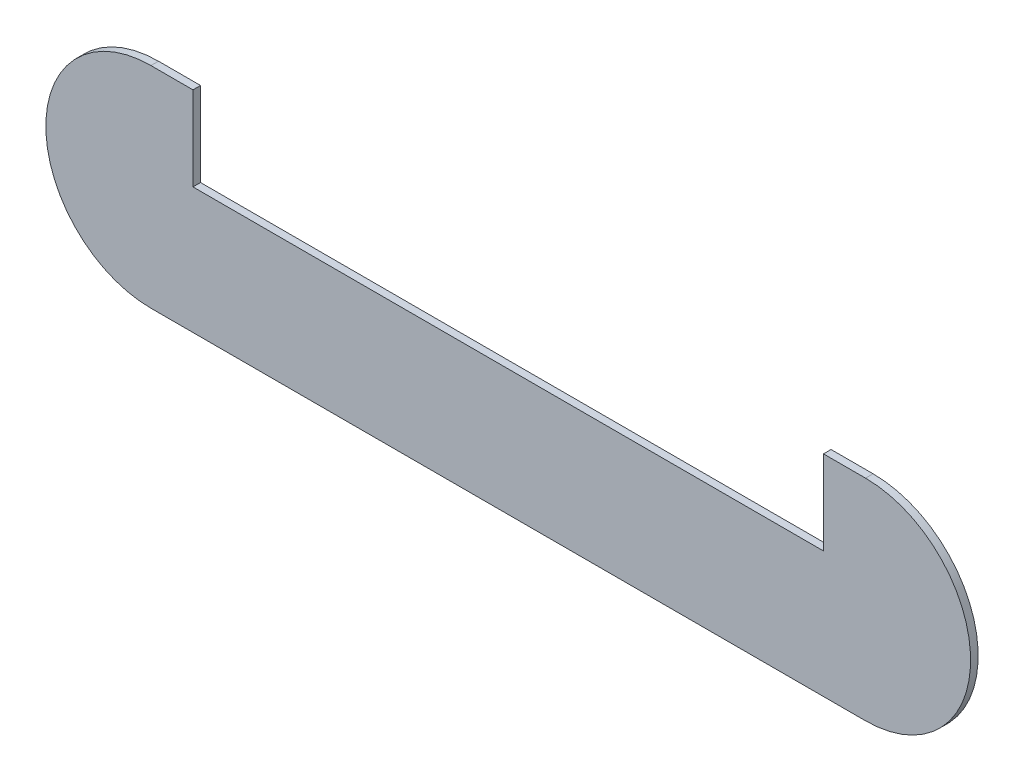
ISO-10303-21;
HEADER;
FILE_DESCRIPTION(('STEP AP214'),'2;1');
FILE_NAME('part.step','',(''),(''),'','','');
FILE_SCHEMA(('AUTOMOTIVE_DESIGN { 1 0 10303 214 1 1 1 1 }'));
ENDSEC;
DATA;
#1=APPLICATION_CONTEXT('core data for automotive mechanical design processes');
#2=APPLICATION_PROTOCOL_DEFINITION('international standard','automotive_design',2000,#1);
#3=PRODUCT_CONTEXT('',#1,'mechanical');
#4=PRODUCT('Part','Part','',(#3));
#5=PRODUCT_RELATED_PRODUCT_CATEGORY('part','',(#4));
#6=PRODUCT_DEFINITION_FORMATION('','',#4);
#7=PRODUCT_DEFINITION_CONTEXT('part definition',#1,'design');
#8=PRODUCT_DEFINITION('design','',#6,#7);
#9=PRODUCT_DEFINITION_SHAPE('','',#8);
#10=(LENGTH_UNIT() NAMED_UNIT(*) SI_UNIT(.MILLI.,.METRE.));
#11=(NAMED_UNIT(*) PLANE_ANGLE_UNIT() SI_UNIT($,.RADIAN.));
#12=(NAMED_UNIT(*) SI_UNIT($,.STERADIAN.) SOLID_ANGLE_UNIT());
#13=UNCERTAINTY_MEASURE_WITH_UNIT(LENGTH_MEASURE(1.E-05),#10,'distance_accuracy_value','');
#14=(GEOMETRIC_REPRESENTATION_CONTEXT(3) GLOBAL_UNCERTAINTY_ASSIGNED_CONTEXT((#13)) GLOBAL_UNIT_ASSIGNED_CONTEXT((#10,
#11,#12)) REPRESENTATION_CONTEXT('',''));
#15=CARTESIAN_POINT('',(0.,0.,0.));
#16=DIRECTION('',(0.,0.,1.));
#17=DIRECTION('',(1.,0.,0.));
#18=AXIS2_PLACEMENT_3D('',#15,#16,#17);
#19=CARTESIAN_POINT('',(-850.000000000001,250.,18.));
#20=DIRECTION('',(0.,-1.,0.));
#21=DIRECTION('',(0.,0.,-1.));
#22=AXIS2_PLACEMENT_3D('',#19,#20,#21);
#23=PLANE('',#22);
#24=DIRECTION('',(0.,0.,-1.));
#25=VECTOR('',#24,1.);
#26=CARTESIAN_POINT('',(-750.000000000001,250.,2860.71829828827));
#27=LINE('',#26,#25);
#28=CARTESIAN_POINT('',(-750.000000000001,250.,17.9999999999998));
#29=VERTEX_POINT('',#28);
#30=CARTESIAN_POINT('',(-750.,250.,0.));
#31=VERTEX_POINT('',#30);
#32=EDGE_CURVE('E162',#29,#31,#27,.T.);
#33=ORIENTED_EDGE('',*,*,#32,.T.);
#34=DIRECTION('',(-1.,0.,0.));
#35=VECTOR('',#34,1.);
#36=CARTESIAN_POINT('',(-850.000000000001,250.,0.));
#37=LINE('',#36,#35);
#38=CARTESIAN_POINT('',(-850.000000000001,250.,0.));
#39=VERTEX_POINT('',#38);
#40=EDGE_CURVE('E127',#31,#39,#37,.T.);
#41=ORIENTED_EDGE('',*,*,#40,.T.);
#42=DIRECTION('',(0.,0.,-1.));
#43=VECTOR('',#42,1.);
#44=CARTESIAN_POINT('',(-850.000000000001,250.,18.));
#45=LINE('',#44,#43);
#46=CARTESIAN_POINT('',(-850.000000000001,250.,18.));
#47=VERTEX_POINT('',#46);
#48=EDGE_CURVE('E41',#47,#39,#45,.T.);
#49=ORIENTED_EDGE('',*,*,#48,.F.);
#50=DIRECTION('',(-1.,0.,0.));
#51=VECTOR('',#50,1.);
#52=CARTESIAN_POINT('',(-850.000000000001,250.,18.));
#53=LINE('',#52,#51);
#54=EDGE_CURVE('E167',#29,#47,#53,.T.);
#55=ORIENTED_EDGE('',*,*,#54,.F.);
#56=EDGE_LOOP('',(#33,#41,#49,#55));
#57=FACE_BOUND('',#56,.T.);
#58=ADVANCED_FACE('F33',(#57),#23,.F.);
#59=DIRECTION('',(0.,0.,-1.));
#60=VECTOR('',#59,1.);
#61=CARTESIAN_POINT('',(750.,250.,2860.71829828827));
#62=LINE('',#61,#60);
#63=CARTESIAN_POINT('',(750.,250.,17.9999999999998));
#64=VERTEX_POINT('',#63);
#65=CARTESIAN_POINT('',(750.,250.,0.));
#66=VERTEX_POINT('',#65);
#67=EDGE_CURVE('E106',#64,#66,#62,.T.);
#68=ORIENTED_EDGE('',*,*,#67,.F.);
#69=CARTESIAN_POINT('',(850.,250.,18.));
#70=VERTEX_POINT('',#69);
#71=EDGE_CURVE('E85',#70,#64,#53,.T.);
#72=ORIENTED_EDGE('',*,*,#71,.F.);
#73=DIRECTION('',(0.,0.,-1.));
#74=VECTOR('',#73,1.);
#75=CARTESIAN_POINT('',(850.,250.,18.));
#76=LINE('',#75,#74);
#77=CARTESIAN_POINT('',(850.,250.,0.));
#78=VERTEX_POINT('',#77);
#79=EDGE_CURVE('E11',#70,#78,#76,.T.);
#80=ORIENTED_EDGE('',*,*,#79,.T.);
#81=EDGE_CURVE('E119',#78,#66,#37,.T.);
#82=ORIENTED_EDGE('',*,*,#81,.T.);
#83=EDGE_LOOP('',(#68,#72,#80,#82));
#84=FACE_BOUND('',#83,.T.);
#85=ADVANCED_FACE('F123',(#84),#23,.F.);
#86=CARTESIAN_POINT('',(850.,-1.11022302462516E-13,18.));
#87=DIRECTION('',(0.,0.,1.));
#88=DIRECTION('',(1.,0.,0.));
#89=AXIS2_PLACEMENT_3D('',#86,#87,#88);
#90=PLANE('',#89);
#91=DIRECTION('',(1.,0.,0.));
#92=VECTOR('',#91,1.);
#93=CARTESIAN_POINT('',(-750.000000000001,49.9999999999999,17.9999999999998));
#94=LINE('',#93,#92);
#95=CARTESIAN_POINT('',(-750.000000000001,49.9999999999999,17.9999999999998));
#96=VERTEX_POINT('',#95);
#97=CARTESIAN_POINT('',(750.,49.9999999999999,17.9999999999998));
#98=VERTEX_POINT('',#97);
#99=EDGE_CURVE('E151',#96,#98,#94,.T.);
#100=ORIENTED_EDGE('',*,*,#99,.F.);
#101=DIRECTION('',(0.,-1.,0.));
#102=VECTOR('',#101,1.);
#103=CARTESIAN_POINT('',(-750.000000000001,250.,17.9999999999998));
#104=LINE('',#103,#102);
#105=EDGE_CURVE('E153',#29,#96,#104,.T.);
#106=ORIENTED_EDGE('',*,*,#105,.F.);
#107=ORIENTED_EDGE('',*,*,#54,.T.);
#108=CARTESIAN_POINT('',(-850.000000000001,-1.11022302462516E-13,18.));
#109=DIRECTION('',(0.,0.,1.));
#110=DIRECTION('',(1.,0.,0.));
#111=AXIS2_PLACEMENT_3D('',#108,#109,#110);
#112=CIRCLE('',#111,250.);
#113=CARTESIAN_POINT('',(-850.000000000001,-250.,18.));
#114=VERTEX_POINT('',#113);
#115=EDGE_CURVE('E146',#47,#114,#112,.T.);
#116=ORIENTED_EDGE('',*,*,#115,.T.);
#117=DIRECTION('',(1.,0.,0.));
#118=VECTOR('',#117,1.);
#119=CARTESIAN_POINT('',(-850.000000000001,-250.,18.));
#120=LINE('',#119,#118);
#121=CARTESIAN_POINT('',(850.,-250.,18.));
#122=VERTEX_POINT('',#121);
#123=EDGE_CURVE('E57',#114,#122,#120,.T.);
#124=ORIENTED_EDGE('',*,*,#123,.T.);
#125=CARTESIAN_POINT('',(850.,-1.11022302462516E-13,18.));
#126=DIRECTION('',(0.,0.,1.));
#127=DIRECTION('',(1.,0.,0.));
#128=AXIS2_PLACEMENT_3D('',#125,#126,#127);
#129=CIRCLE('',#128,250.);
#130=EDGE_CURVE('E135',#122,#70,#129,.T.);
#131=ORIENTED_EDGE('',*,*,#130,.T.);
#132=ORIENTED_EDGE('',*,*,#71,.T.);
#133=DIRECTION('',(0.,1.,0.));
#134=VECTOR('',#133,1.);
#135=CARTESIAN_POINT('',(750.,49.9999999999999,17.9999999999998));
#136=LINE('',#135,#134);
#137=EDGE_CURVE('E112',#98,#64,#136,.T.);
#138=ORIENTED_EDGE('',*,*,#137,.F.);
#139=EDGE_LOOP('',(#100,#106,#107,#116,#124,#131,#132,#138));
#140=FACE_BOUND('',#139,.T.);
#141=ADVANCED_FACE('F170',(#140),#90,.T.);
#142=CARTESIAN_POINT('',(850.,-1.11022302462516E-13,18.));
#143=DIRECTION('',(0.,0.,-1.));
#144=DIRECTION('',(-1.,0.,0.));
#145=AXIS2_PLACEMENT_3D('',#142,#143,#144);
#146=CYLINDRICAL_SURFACE('',#145,250.);
#147=CARTESIAN_POINT('',(850.,-1.11022302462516E-13,0.));
#148=DIRECTION('',(0.,0.,1.));
#149=DIRECTION('',(1.,0.,0.));
#150=AXIS2_PLACEMENT_3D('',#147,#148,#149);
#151=CIRCLE('',#150,250.);
#152=CARTESIAN_POINT('',(850.,-250.,0.));
#153=VERTEX_POINT('',#152);
#154=EDGE_CURVE('E130',#153,#78,#151,.T.);
#155=ORIENTED_EDGE('',*,*,#154,.T.);
#156=ORIENTED_EDGE('',*,*,#79,.F.);
#157=ORIENTED_EDGE('',*,*,#130,.F.);
#158=DIRECTION('',(0.,0.,-1.));
#159=VECTOR('',#158,1.);
#160=CARTESIAN_POINT('',(850.,-250.,18.));
#161=LINE('',#160,#159);
#162=EDGE_CURVE('E136',#122,#153,#161,.T.);
#163=ORIENTED_EDGE('',*,*,#162,.T.);
#164=EDGE_LOOP('',(#155,#156,#157,#163));
#165=FACE_BOUND('',#164,.T.);
#166=ADVANCED_FACE('F35',(#165),#146,.T.);
#167=CARTESIAN_POINT('',(-850.000000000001,-1.11022302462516E-13,18.));
#168=DIRECTION('',(0.,0.,-1.));
#169=DIRECTION('',(-1.,0.,0.));
#170=AXIS2_PLACEMENT_3D('',#167,#168,#169);
#171=CYLINDRICAL_SURFACE('',#170,250.);
#172=CARTESIAN_POINT('',(-850.000000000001,-1.11022302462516E-13,0.));
#173=DIRECTION('',(0.,0.,1.));
#174=DIRECTION('',(1.,0.,0.));
#175=AXIS2_PLACEMENT_3D('',#172,#173,#174);
#176=CIRCLE('',#175,250.);
#177=CARTESIAN_POINT('',(-850.000000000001,-250.,0.));
#178=VERTEX_POINT('',#177);
#179=EDGE_CURVE('E126',#39,#178,#176,.T.);
#180=ORIENTED_EDGE('',*,*,#179,.T.);
#181=DIRECTION('',(0.,0.,-1.));
#182=VECTOR('',#181,1.);
#183=CARTESIAN_POINT('',(-850.000000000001,-250.,18.));
#184=LINE('',#183,#182);
#185=EDGE_CURVE('E138',#114,#178,#184,.T.);
#186=ORIENTED_EDGE('',*,*,#185,.F.);
#187=ORIENTED_EDGE('',*,*,#115,.F.);
#188=ORIENTED_EDGE('',*,*,#48,.T.);
#189=EDGE_LOOP('',(#180,#186,#187,#188));
#190=FACE_BOUND('',#189,.T.);
#191=ADVANCED_FACE('F144',(#190),#171,.T.);
#192=CARTESIAN_POINT('',(-850.000000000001,-250.,18.));
#193=DIRECTION('',(0.,1.,0.));
#194=DIRECTION('',(0.,0.,1.));
#195=AXIS2_PLACEMENT_3D('',#192,#193,#194);
#196=PLANE('',#195);
#197=DIRECTION('',(1.,0.,0.));
#198=VECTOR('',#197,1.);
#199=CARTESIAN_POINT('',(-850.000000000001,-250.,0.));
#200=LINE('',#199,#198);
#201=EDGE_CURVE('E78',#178,#153,#200,.T.);
#202=ORIENTED_EDGE('',*,*,#201,.T.);
#203=ORIENTED_EDGE('',*,*,#162,.F.);
#204=ORIENTED_EDGE('',*,*,#123,.F.);
#205=ORIENTED_EDGE('',*,*,#185,.T.);
#206=EDGE_LOOP('',(#202,#203,#204,#205));
#207=FACE_BOUND('',#206,.T.);
#208=ADVANCED_FACE('F172',(#207),#196,.F.);
#209=CARTESIAN_POINT('',(850.,-1.11022302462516E-13,0.));
#210=DIRECTION('',(0.,0.,1.));
#211=DIRECTION('',(1.,0.,0.));
#212=AXIS2_PLACEMENT_3D('',#209,#210,#211);
#213=PLANE('',#212);
#214=DIRECTION('',(1.,0.,0.));
#215=VECTOR('',#214,1.);
#216=CARTESIAN_POINT('',(-750.000000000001,49.9999999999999,0.));
#217=LINE('',#216,#215);
#218=CARTESIAN_POINT('',(-750.,49.9999999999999,0.));
#219=VERTEX_POINT('',#218);
#220=CARTESIAN_POINT('',(750.,49.9999999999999,0.));
#221=VERTEX_POINT('',#220);
#222=EDGE_CURVE('E121',#219,#221,#217,.T.);
#223=ORIENTED_EDGE('',*,*,#222,.T.);
#224=DIRECTION('',(0.,1.,0.));
#225=VECTOR('',#224,1.);
#226=CARTESIAN_POINT('',(750.,49.9999999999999,0.));
#227=LINE('',#226,#225);
#228=EDGE_CURVE('E109',#221,#66,#227,.T.);
#229=ORIENTED_EDGE('',*,*,#228,.T.);
#230=ORIENTED_EDGE('',*,*,#81,.F.);
#231=ORIENTED_EDGE('',*,*,#154,.F.);
#232=ORIENTED_EDGE('',*,*,#201,.F.);
#233=ORIENTED_EDGE('',*,*,#179,.F.);
#234=ORIENTED_EDGE('',*,*,#40,.F.);
#235=DIRECTION('',(0.,-1.,0.));
#236=VECTOR('',#235,1.);
#237=CARTESIAN_POINT('',(-750.000000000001,250.,0.));
#238=LINE('',#237,#236);
#239=EDGE_CURVE('E114',#31,#219,#238,.T.);
#240=ORIENTED_EDGE('',*,*,#239,.T.);
#241=EDGE_LOOP('',(#223,#229,#230,#231,#232,#233,#234,#240));
#242=FACE_BOUND('',#241,.T.);
#243=ADVANCED_FACE('F117',(#242),#213,.F.);
#244=CARTESIAN_POINT('',(-750.000000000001,250.,2860.71829828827));
#245=DIRECTION('',(1.,0.,0.));
#246=DIRECTION('',(0.,0.,-1.));
#247=AXIS2_PLACEMENT_3D('',#244,#245,#246);
#248=PLANE('',#247);
#249=ORIENTED_EDGE('',*,*,#32,.F.);
#250=ORIENTED_EDGE('',*,*,#105,.T.);
#251=DIRECTION('',(0.,0.,-1.));
#252=VECTOR('',#251,1.);
#253=CARTESIAN_POINT('',(-750.000000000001,49.9999999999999,2860.71829828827));
#254=LINE('',#253,#252);
#255=EDGE_CURVE('E159',#96,#219,#254,.T.);
#256=ORIENTED_EDGE('',*,*,#255,.T.);
#257=ORIENTED_EDGE('',*,*,#239,.F.);
#258=EDGE_LOOP('',(#249,#250,#256,#257));
#259=FACE_BOUND('',#258,.T.);
#260=ADVANCED_FACE('F177',(#259),#248,.T.);
#261=CARTESIAN_POINT('',(-750.000000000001,49.9999999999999,2860.71829828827));
#262=DIRECTION('',(0.,1.,0.));
#263=DIRECTION('',(0.,0.,1.));
#264=AXIS2_PLACEMENT_3D('',#261,#262,#263);
#265=PLANE('',#264);
#266=ORIENTED_EDGE('',*,*,#255,.F.);
#267=ORIENTED_EDGE('',*,*,#99,.T.);
#268=DIRECTION('',(0.,0.,-1.));
#269=VECTOR('',#268,1.);
#270=CARTESIAN_POINT('',(750.,49.9999999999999,2860.71829828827));
#271=LINE('',#270,#269);
#272=EDGE_CURVE('E48',#98,#221,#271,.T.);
#273=ORIENTED_EDGE('',*,*,#272,.T.);
#274=ORIENTED_EDGE('',*,*,#222,.F.);
#275=EDGE_LOOP('',(#266,#267,#273,#274));
#276=FACE_BOUND('',#275,.T.);
#277=ADVANCED_FACE('F175',(#276),#265,.T.);
#278=CARTESIAN_POINT('',(750.,49.9999999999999,2860.71829828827));
#279=DIRECTION('',(-1.,0.,0.));
#280=DIRECTION('',(0.,0.,1.));
#281=AXIS2_PLACEMENT_3D('',#278,#279,#280);
#282=PLANE('',#281);
#283=ORIENTED_EDGE('',*,*,#272,.F.);
#284=ORIENTED_EDGE('',*,*,#137,.T.);
#285=ORIENTED_EDGE('',*,*,#67,.T.);
#286=ORIENTED_EDGE('',*,*,#228,.F.);
#287=EDGE_LOOP('',(#283,#284,#285,#286));
#288=FACE_BOUND('',#287,.T.);
#289=ADVANCED_FACE('F108',(#288),#282,.T.);
#290=CLOSED_SHELL('',(#58,#85,#141,#166,#191,#208,#243,#260,#277,#289));
#291=MANIFOLD_SOLID_BREP('B2',#290);
#292=ADVANCED_BREP_SHAPE_REPRESENTATION('',(#18,#291),#14);
#293=SHAPE_DEFINITION_REPRESENTATION(#9,#292);
ENDSEC;
END-ISO-10303-21;
